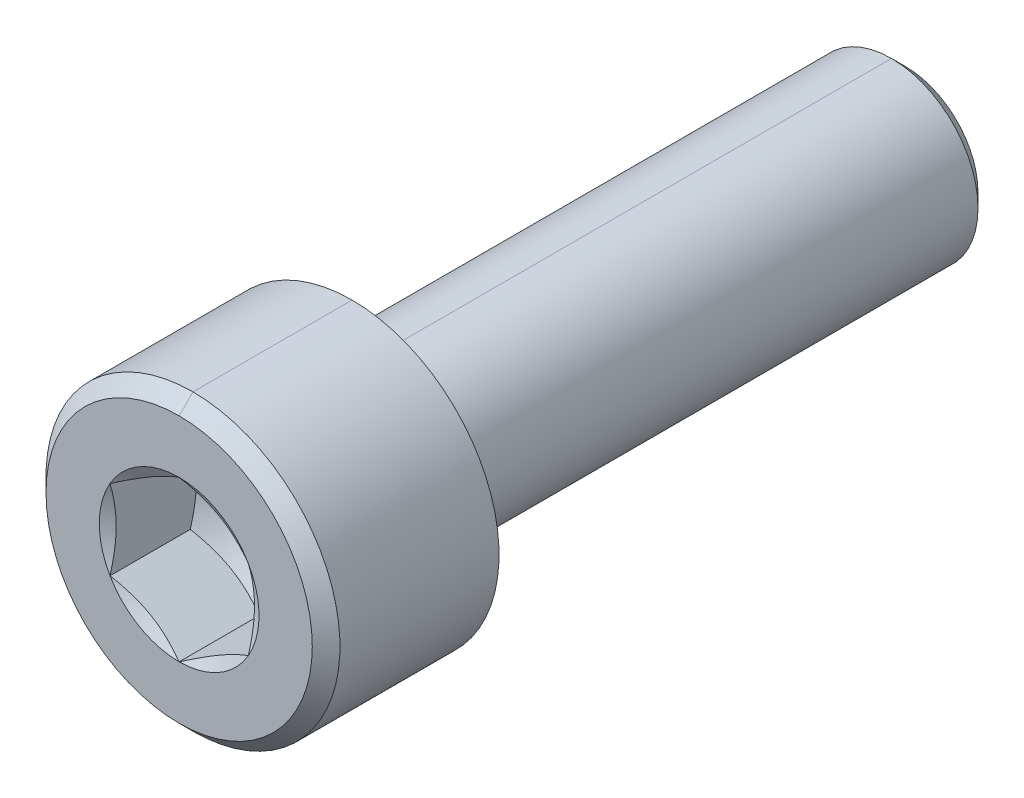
ISO-10303-21;
HEADER;
FILE_DESCRIPTION(('STEP AP214'),'2;1');
FILE_NAME('part.step','',(''),(''),'','','');
FILE_SCHEMA(('AUTOMOTIVE_DESIGN { 1 0 10303 214 1 1 1 1 }'));
ENDSEC;
DATA;
#1=APPLICATION_CONTEXT('core data for automotive mechanical design processes');
#2=APPLICATION_PROTOCOL_DEFINITION('international standard','automotive_design',2000,#1);
#3=PRODUCT_CONTEXT('',#1,'mechanical');
#4=PRODUCT('Part','Part','',(#3));
#5=PRODUCT_RELATED_PRODUCT_CATEGORY('part','',(#4));
#6=PRODUCT_DEFINITION_FORMATION('','',#4);
#7=PRODUCT_DEFINITION_CONTEXT('part definition',#1,'design');
#8=PRODUCT_DEFINITION('design','',#6,#7);
#9=PRODUCT_DEFINITION_SHAPE('','',#8);
#10=(LENGTH_UNIT() NAMED_UNIT(*) SI_UNIT(.MILLI.,.METRE.));
#11=(NAMED_UNIT(*) PLANE_ANGLE_UNIT() SI_UNIT($,.RADIAN.));
#12=(NAMED_UNIT(*) SI_UNIT($,.STERADIAN.) SOLID_ANGLE_UNIT());
#13=UNCERTAINTY_MEASURE_WITH_UNIT(LENGTH_MEASURE(1.E-05),#10,'distance_accuracy_value','');
#14=(GEOMETRIC_REPRESENTATION_CONTEXT(3) GLOBAL_UNCERTAINTY_ASSIGNED_CONTEXT((#13)) GLOBAL_UNIT_ASSIGNED_CONTEXT((#10,
#11,#12)) REPRESENTATION_CONTEXT('',''));
#15=CARTESIAN_POINT('',(0.,0.,0.));
#16=DIRECTION('',(0.,0.,1.));
#17=DIRECTION('',(1.,0.,0.));
#18=AXIS2_PLACEMENT_3D('',#15,#16,#17);
#19=CARTESIAN_POINT('',(2.,1.154700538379,-16.001));
#20=DIRECTION('',(0.500000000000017,0.866025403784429,0.));
#21=DIRECTION('',(0.,0.,-1.));
#22=AXIS2_PLACEMENT_3D('',#19,#20,#21);
#23=PLANE('',#22);
#24=DIRECTION('',(0.,0.,-1.));
#25=VECTOR('',#24,1.);
#26=CARTESIAN_POINT('',(0.,2.309401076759,5.));
#27=LINE('',#26,#25);
#28=CARTESIAN_POINT('',(0.,2.309401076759,5.));
#29=VERTEX_POINT('',#28);
#30=CARTESIAN_POINT('',(0.,2.309401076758,2.678632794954));
#31=VERTEX_POINT('',#30);
#32=EDGE_CURVE('E517',#29,#31,#27,.T.);
#33=ORIENTED_EDGE('',*,*,#32,.T.);
#34=CARTESIAN_POINT('',(1.99999999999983,1.1547005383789,2.67863279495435));
#35=CARTESIAN_POINT('',(1.95801085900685,1.17894000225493,2.66463684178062));
#36=CARTESIAN_POINT('',(1.9158626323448,1.20326208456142,2.65124361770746));
#37=CARTESIAN_POINT('',(1.83232483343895,1.25146918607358,2.62615601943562));
#38=CARTESIAN_POINT('',(1.79094297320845,1.2753497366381,2.61442729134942));
#39=CARTESIAN_POINT('',(1.70874091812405,1.32280491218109,2.59266350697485));
#40=CARTESIAN_POINT('',(1.66792649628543,1.34637583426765,2.58259877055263));
#41=CARTESIAN_POINT('',(1.58663122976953,1.39334468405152,2.56416342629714));
#42=CARTESIAN_POINT('',(1.54615407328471,1.41674019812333,2.55577046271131));
#43=CARTESIAN_POINT('',(1.46305092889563,1.46470165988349,2.54024024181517));
#44=CARTESIAN_POINT('',(1.42041267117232,1.48927136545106,2.53317968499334));
#45=CARTESIAN_POINT('',(1.33570175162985,1.53809491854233,2.52111074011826));
#46=CARTESIAN_POINT('',(1.2936327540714,1.56234647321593,2.51606764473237));
#47=CARTESIAN_POINT('',(1.20968648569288,1.61081288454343,2.50802275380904));
#48=CARTESIAN_POINT('',(1.16781003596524,1.63502673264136,2.50500642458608));
#49=CARTESIAN_POINT('',(1.0838064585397,1.68362115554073,2.50099027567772));
#50=CARTESIAN_POINT('',(1.04167904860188,1.70800199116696,2.49999955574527));
#51=CARTESIAN_POINT('',(0.95749422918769,1.75660531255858,2.50001470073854));
#52=CARTESIAN_POINT('',(0.915436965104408,1.78082805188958,2.50101485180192));
#53=CARTESIAN_POINT('',(0.831574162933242,1.82915898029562,2.50504329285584));
#54=CARTESIAN_POINT('',(0.789768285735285,1.85326724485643,2.50806358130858));
#55=CARTESIAN_POINT('',(0.706005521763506,1.90164257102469,2.51610820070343));
#56=CARTESIAN_POINT('',(0.664049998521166,1.92590940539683,2.5211479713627));
#57=CARTESIAN_POINT('',(0.579553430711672,1.97478384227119,2.53320196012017));
#58=CARTESIAN_POINT('',(0.537016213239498,1.99938927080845,2.54025152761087));
#59=CARTESIAN_POINT('',(0.453973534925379,2.04734499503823,2.55576591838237));
#60=CARTESIAN_POINT('',(0.413459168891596,2.07070386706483,2.56415708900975));
#61=CARTESIAN_POINT('',(0.332108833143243,2.11762862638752,2.58259060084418));
#62=CARTESIAN_POINT('',(0.291276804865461,2.14119255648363,2.59265526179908));
#63=CARTESIAN_POINT('',(0.2090566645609,2.18865999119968,2.61441975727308));
#64=CARTESIAN_POINT('',(0.16767464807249,2.21256036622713,2.62614924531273));
#65=CARTESIAN_POINT('',(0.0841393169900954,2.26080899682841,2.65123936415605));
#66=CARTESIAN_POINT('',(0.0419937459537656,2.28515284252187,2.66463434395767));
#67=CARTESIAN_POINT('',(0.,2.30940107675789,2.67863279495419));
#68=B_SPLINE_CURVE_WITH_KNOTS('',3,(#34,#35,#36,#37,#38,#39,#40,#41,#42,#43,#44,#45,#46,#47,#48,
#49,#50,#51,#52,#53,#54,#55,#56,#57,#58,#59,#60,#61,#62,#63,#64,#65,#66,#67),.UNSPECIFIED.,.F.,
.F.,(4,2,2,2,2,2,2,2,2,2,2,2,2,2,2,2,4),(0.,0.151392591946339,0.29896297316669,
0.443521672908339,0.585993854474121,0.735102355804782,0.881522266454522,1.02688068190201,
1.17289067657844,1.31848222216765,1.46350048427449,1.60964929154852,1.75854660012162,
1.90105886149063,2.04565193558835,2.19325210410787,2.34467088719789),.UNSPECIFIED.);
#69=CARTESIAN_POINT('',(2.,1.154700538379,2.678632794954));
#70=VERTEX_POINT('',#69);
#71=EDGE_CURVE('E290',#70,#31,#68,.T.);
#72=ORIENTED_EDGE('',*,*,#71,.F.);
#73=DIRECTION('',(0.,0.,-1.));
#74=VECTOR('',#73,1.);
#75=CARTESIAN_POINT('',(2.,1.154700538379,5.));
#76=LINE('',#75,#74);
#77=CARTESIAN_POINT('',(2.,1.154700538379,5.));
#78=VERTEX_POINT('',#77);
#79=EDGE_CURVE('E547',#78,#70,#76,.T.);
#80=ORIENTED_EDGE('',*,*,#79,.F.);
#81=CARTESIAN_POINT('',(0.,2.30940107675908,4.99999999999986));
#82=CARTESIAN_POINT('',(0.0419833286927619,2.28515896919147,4.9860050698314));
#83=CARTESIAN_POINT('',(0.0841190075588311,2.26082208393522,4.97261379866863));
#84=CARTESIAN_POINT('',(0.167642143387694,2.21258360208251,4.94752844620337));
#85=CARTESIAN_POINT('',(0.209021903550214,2.18868637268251,4.93580025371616));
#86=CARTESIAN_POINT('',(0.291243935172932,2.1412206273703,4.91403592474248));
#87=CARTESIAN_POINT('',(0.332080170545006,2.11765522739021,4.90397038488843));
#88=CARTESIAN_POINT('',(0.413442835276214,2.07072038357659,4.8855316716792));
#89=CARTESIAN_POINT('',(0.453965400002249,2.04735292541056,4.87713644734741));
#90=CARTESIAN_POINT('',(0.536994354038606,1.99939851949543,4.86162093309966));
#91=CARTESIAN_POINT('',(0.579509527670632,1.97480318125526,4.85457305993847));
#92=CARTESIAN_POINT('',(0.663978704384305,1.92594497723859,4.84252128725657));
#93=CARTESIAN_POINT('',(0.705928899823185,1.90168417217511,4.83748263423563));
#94=CARTESIAN_POINT('',(0.78969468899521,1.8533130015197,4.82943832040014));
#95=CARTESIAN_POINT('',(0.831508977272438,1.82920285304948,4.82641787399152));
#96=CARTESIAN_POINT('',(0.915399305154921,1.78085596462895,4.82238612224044));
#97=CARTESIAN_POINT('',(0.957475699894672,1.75661912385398,4.82138345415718));
#98=CARTESIAN_POINT('',(1.04165779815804,1.70801114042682,4.82136521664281));
#99=CARTESIAN_POINT('',(1.08376340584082,1.68363983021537,4.82235342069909));
#100=CARTESIAN_POINT('',(1.16773937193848,1.63506128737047,4.82636626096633));
#101=CARTESIAN_POINT('',(1.2096099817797,1.61085379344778,4.82938243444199));
#102=CARTESIAN_POINT('',(1.29355834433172,1.56239209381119,4.83742763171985));
#103=CARTESIAN_POINT('',(1.33563523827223,1.53813894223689,4.84247184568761));
#104=CARTESIAN_POINT('',(1.42037393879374,1.48929976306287,4.85454300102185));
#105=CARTESIAN_POINT('',(1.46303197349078,1.46471598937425,4.86160524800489));
#106=CARTESIAN_POINT('',(1.54614311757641,1.41674328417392,4.87713433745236));
#107=CARTESIAN_POINT('',(1.58660871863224,1.39335058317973,4.88552324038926));
#108=CARTESIAN_POINT('',(1.66788906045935,1.34638737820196,4.90395337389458));
#109=CARTESIAN_POINT('',(1.70870009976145,1.32281936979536,4.914017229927));
#110=CARTESIAN_POINT('',(1.79090267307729,1.27536668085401,4.93578118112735));
#111=CARTESIAN_POINT('',(1.83228839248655,1.25148574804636,4.94751120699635));
#112=CARTESIAN_POINT('',(1.91584110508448,1.20327314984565,4.97260358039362));
#113=CARTESIAN_POINT('',(1.95800032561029,1.17894597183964,4.98600051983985));
#114=CARTESIAN_POINT('',(2.00000000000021,1.15470053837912,4.99999999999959));
#115=B_SPLINE_CURVE_WITH_KNOTS('',3,(#81,#82,#83,#84,#85,#86,#87,#88,#89,#90,#91,#92,#93,#94,
#95,#96,#97,#98,#99,#100,#101,#102,#103,#104,#105,#106,#107,#108,#109,#110,#111,#112,#113,#114),
.UNSPECIFIED.,.F.,.F.,(4,2,2,2,2,2,2,2,2,2,2,2,2,2,2,2,4),(0.,0.151380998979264,
0.298969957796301,0.443576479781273,0.586124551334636,0.734949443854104,0.881075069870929,
1.02611807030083,1.17178062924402,1.31771953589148,1.46305318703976,1.60949630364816,
1.75867729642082,1.90111360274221,2.04565883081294,2.19324044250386,2.34467088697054),.UNSPECIFIED.);
#116=EDGE_CURVE('E11',#29,#78,#115,.T.);
#117=ORIENTED_EDGE('',*,*,#116,.F.);
#118=EDGE_LOOP('',(#33,#72,#80,#117));
#119=FACE_BOUND('',#118,.T.);
#120=ADVANCED_FACE('F17',(#119),#23,.F.);
#121=CARTESIAN_POINT('',(0.,0.,4.910153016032));
#122=DIRECTION('',(0.,0.,1.));
#123=DIRECTION('',(0.,-1.,0.));
#124=AXIS2_PLACEMENT_3D('',#121,#122,#123);
#125=CONICAL_SURFACE('',#124,2.15378153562,1.0471975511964);
#126=ORIENTED_EDGE('',*,*,#116,.T.);
#127=CARTESIAN_POINT('',(0.,0.,5.));
#128=DIRECTION('',(0.,0.,-1.));
#129=DIRECTION('',(0.,1.,0.));
#130=AXIS2_PLACEMENT_3D('',#127,#128,#129);
#131=CIRCLE('',#130,2.309401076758);
#132=EDGE_CURVE('E29',#29,#78,#131,.T.);
#133=ORIENTED_EDGE('',*,*,#132,.F.);
#134=EDGE_LOOP('',(#126,#133));
#135=FACE_BOUND('',#134,.T.);
#136=ADVANCED_FACE('F587',(#135),#125,.F.);
#137=CARTESIAN_POINT('',(0.,4.25,5.));
#138=DIRECTION('',(0.,0.,-1.));
#139=DIRECTION('',(0.,-1.,0.));
#140=AXIS2_PLACEMENT_3D('',#137,#138,#139);
#141=PLANE('',#140);
#142=ORIENTED_EDGE('',*,*,#132,.T.);
#143=CARTESIAN_POINT('',(0.,0.,5.));
#144=DIRECTION('',(0.,0.,-1.));
#145=DIRECTION('',(0.866025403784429,0.500000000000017,0.));
#146=AXIS2_PLACEMENT_3D('',#143,#144,#145);
#147=CIRCLE('',#146,2.309401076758);
#148=CARTESIAN_POINT('',(2.,-1.154700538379,5.));
#149=VERTEX_POINT('',#148);
#150=EDGE_CURVE('E549',#78,#149,#147,.T.);
#151=ORIENTED_EDGE('',*,*,#150,.T.);
#152=CARTESIAN_POINT('',(0.,0.,5.));
#153=DIRECTION('',(0.,0.,-1.));
#154=DIRECTION('',(0.866025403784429,-0.500000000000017,0.));
#155=AXIS2_PLACEMENT_3D('',#152,#153,#154);
#156=CIRCLE('',#155,2.309401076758);
#157=CARTESIAN_POINT('',(0.,-2.309401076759,5.));
#158=VERTEX_POINT('',#157);
#159=EDGE_CURVE('E169',#149,#158,#156,.T.);
#160=ORIENTED_EDGE('',*,*,#159,.T.);
#161=CARTESIAN_POINT('',(0.,0.,5.));
#162=DIRECTION('',(0.,0.,-1.));
#163=DIRECTION('',(0.,-1.,0.));
#164=AXIS2_PLACEMENT_3D('',#161,#162,#163);
#165=CIRCLE('',#164,2.309401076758);
#166=CARTESIAN_POINT('',(-2.,-1.154700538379,5.));
#167=VERTEX_POINT('',#166);
#168=EDGE_CURVE('E160',#158,#167,#165,.T.);
#169=ORIENTED_EDGE('',*,*,#168,.T.);
#170=CARTESIAN_POINT('',(0.,0.,5.));
#171=DIRECTION('',(0.,0.,-1.));
#172=DIRECTION('',(-0.866025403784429,-0.500000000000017,0.));
#173=AXIS2_PLACEMENT_3D('',#170,#171,#172);
#174=CIRCLE('',#173,2.309401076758);
#175=CARTESIAN_POINT('',(-2.,1.154700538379,5.));
#176=VERTEX_POINT('',#175);
#177=EDGE_CURVE('E166',#167,#176,#174,.T.);
#178=ORIENTED_EDGE('',*,*,#177,.T.);
#179=CARTESIAN_POINT('',(0.,0.,5.));
#180=DIRECTION('',(0.,0.,-1.));
#181=DIRECTION('',(-0.866025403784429,0.500000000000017,0.));
#182=AXIS2_PLACEMENT_3D('',#179,#180,#181);
#183=CIRCLE('',#182,2.309401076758);
#184=EDGE_CURVE('E565',#176,#29,#183,.T.);
#185=ORIENTED_EDGE('',*,*,#184,.T.);
#186=EDGE_LOOP('',(#142,#151,#160,#169,#178,#185));
#187=FACE_BOUND('',#186,.T.);
#188=CARTESIAN_POINT('',(0.,0.,5.));
#189=DIRECTION('',(0.,0.,1.));
#190=DIRECTION('',(0.,-1.,0.));
#191=AXIS2_PLACEMENT_3D('',#188,#189,#190);
#192=CIRCLE('',#191,3.85);
#193=CARTESIAN_POINT('',(0.,-3.85,5.));
#194=VERTEX_POINT('',#193);
#195=CARTESIAN_POINT('',(0.,3.85,5.));
#196=VERTEX_POINT('',#195);
#197=EDGE_CURVE('E1115',#194,#196,#192,.T.);
#198=ORIENTED_EDGE('',*,*,#197,.T.);
#199=CARTESIAN_POINT('',(0.,0.,5.));
#200=DIRECTION('',(0.,0.,1.));
#201=DIRECTION('',(0.,1.,0.));
#202=AXIS2_PLACEMENT_3D('',#199,#200,#201);
#203=CIRCLE('',#202,3.85);
#204=EDGE_CURVE('E42',#196,#194,#203,.T.);
#205=ORIENTED_EDGE('',*,*,#204,.T.);
#206=EDGE_LOOP('',(#198,#205));
#207=FACE_BOUND('',#206,.T.);
#208=ADVANCED_FACE('F163',(#187,#207),#141,.F.);
#209=CARTESIAN_POINT('',(0.,0.,4.8));
#210=DIRECTION('',(0.,0.,-1.));
#211=DIRECTION('',(0.,1.,0.));
#212=AXIS2_PLACEMENT_3D('',#209,#210,#211);
#213=CONICAL_SURFACE('',#212,4.05,0.785398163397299);
#214=ORIENTED_EDGE('',*,*,#204,.F.);
#215=DIRECTION('',(0.,-0.707106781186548,0.707106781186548));
#216=VECTOR('',#215,1.);
#217=CARTESIAN_POINT('',(0.,4.25,4.6));
#218=LINE('',#217,#216);
#219=CARTESIAN_POINT('',(0.,4.25,4.6));
#220=VERTEX_POINT('',#219);
#221=EDGE_CURVE('E1120',#220,#196,#218,.T.);
#222=ORIENTED_EDGE('',*,*,#221,.F.);
#223=CARTESIAN_POINT('',(0.,0.,4.6));
#224=DIRECTION('',(0.,0.,1.));
#225=DIRECTION('',(0.,1.,0.));
#226=AXIS2_PLACEMENT_3D('',#223,#224,#225);
#227=CIRCLE('',#226,4.25);
#228=CARTESIAN_POINT('',(0.,-4.25,4.6));
#229=VERTEX_POINT('',#228);
#230=EDGE_CURVE('E1143',#220,#229,#227,.T.);
#231=ORIENTED_EDGE('',*,*,#230,.T.);
#232=DIRECTION('',(0.,0.707106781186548,0.707106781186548));
#233=VECTOR('',#232,1.);
#234=CARTESIAN_POINT('',(0.,-4.25,4.6));
#235=LINE('',#234,#233);
#236=EDGE_CURVE('E1127',#229,#194,#235,.T.);
#237=ORIENTED_EDGE('',*,*,#236,.T.);
#238=EDGE_LOOP('',(#214,#222,#231,#237));
#239=FACE_BOUND('',#238,.T.);
#240=ADVANCED_FACE('F597',(#239),#213,.T.);
#241=CARTESIAN_POINT('',(0.,0.,4.8));
#242=DIRECTION('',(0.,0.,-1.));
#243=DIRECTION('',(0.,1.,0.));
#244=AXIS2_PLACEMENT_3D('',#241,#242,#243);
#245=CONICAL_SURFACE('',#244,4.05,0.785398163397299);
#246=ORIENTED_EDGE('',*,*,#236,.F.);
#247=CARTESIAN_POINT('',(0.,0.,4.6));
#248=DIRECTION('',(0.,0.,1.));
#249=DIRECTION('',(0.,-1.,0.));
#250=AXIS2_PLACEMENT_3D('',#247,#248,#249);
#251=CIRCLE('',#250,4.25);
#252=EDGE_CURVE('E1131',#229,#220,#251,.T.);
#253=ORIENTED_EDGE('',*,*,#252,.T.);
#254=ORIENTED_EDGE('',*,*,#221,.T.);
#255=ORIENTED_EDGE('',*,*,#197,.F.);
#256=EDGE_LOOP('',(#246,#253,#254,#255));
#257=FACE_BOUND('',#256,.T.);
#258=ADVANCED_FACE('F600',(#257),#245,.T.);
#259=CARTESIAN_POINT('',(0.,0.,5.));
#260=DIRECTION('',(0.,0.,1.));
#261=DIRECTION('',(0.,-1.,0.));
#262=AXIS2_PLACEMENT_3D('',#259,#260,#261);
#263=CYLINDRICAL_SURFACE('',#262,4.25);
#264=DIRECTION('',(0.,0.,-1.));
#265=VECTOR('',#264,1.);
#266=CARTESIAN_POINT('',(0.,4.25,4.6));
#267=LINE('',#266,#265);
#268=CARTESIAN_POINT('',(0.,4.25,0.));
#269=VERTEX_POINT('',#268);
#270=EDGE_CURVE('E1139',#220,#269,#267,.T.);
#271=ORIENTED_EDGE('',*,*,#270,.F.);
#272=ORIENTED_EDGE('',*,*,#252,.F.);
#273=DIRECTION('',(0.,0.,-1.));
#274=VECTOR('',#273,1.);
#275=CARTESIAN_POINT('',(0.,-4.25,4.6));
#276=LINE('',#275,#274);
#277=CARTESIAN_POINT('',(0.,-4.25,0.));
#278=VERTEX_POINT('',#277);
#279=EDGE_CURVE('E1151',#229,#278,#276,.T.);
#280=ORIENTED_EDGE('',*,*,#279,.T.);
#281=CARTESIAN_POINT('',(0.,0.,0.));
#282=DIRECTION('',(0.,0.,-1.));
#283=DIRECTION('',(0.,1.,0.));
#284=AXIS2_PLACEMENT_3D('',#281,#282,#283);
#285=CIRCLE('',#284,4.25);
#286=EDGE_CURVE('E1135',#269,#278,#285,.T.);
#287=ORIENTED_EDGE('',*,*,#286,.F.);
#288=EDGE_LOOP('',(#271,#272,#280,#287));
#289=FACE_BOUND('',#288,.T.);
#290=ADVANCED_FACE('F603',(#289),#263,.T.);
#291=CARTESIAN_POINT('',(0.,2.5,0.));
#292=DIRECTION('',(0.,0.,1.));
#293=DIRECTION('',(1.,0.,0.));
#294=AXIS2_PLACEMENT_3D('',#291,#292,#293);
#295=PLANE('',#294);
#296=CARTESIAN_POINT('',(0.,0.,0.));
#297=DIRECTION('',(0.,0.,1.));
#298=DIRECTION('',(0.,1.,0.));
#299=AXIS2_PLACEMENT_3D('',#296,#297,#298);
#300=CIRCLE('',#299,2.9);
#301=CARTESIAN_POINT('',(0.,2.9,0.));
#302=VERTEX_POINT('',#301);
#303=CARTESIAN_POINT('',(0.,-2.9,0.));
#304=VERTEX_POINT('',#303);
#305=EDGE_CURVE('E1163',#302,#304,#300,.T.);
#306=ORIENTED_EDGE('',*,*,#305,.T.);
#307=CARTESIAN_POINT('',(0.,0.,0.));
#308=DIRECTION('',(0.,0.,1.));
#309=DIRECTION('',(0.,-1.,0.));
#310=AXIS2_PLACEMENT_3D('',#307,#308,#309);
#311=CIRCLE('',#310,2.9);
#312=EDGE_CURVE('E1152',#304,#302,#311,.T.);
#313=ORIENTED_EDGE('',*,*,#312,.T.);
#314=EDGE_LOOP('',(#306,#313));
#315=FACE_BOUND('',#314,.T.);
#316=CARTESIAN_POINT('',(0.,0.,0.));
#317=DIRECTION('',(0.,0.,-1.));
#318=DIRECTION('',(0.,-1.,0.));
#319=AXIS2_PLACEMENT_3D('',#316,#317,#318);
#320=CIRCLE('',#319,4.25);
#321=EDGE_CURVE('E1147',#278,#269,#320,.T.);
#322=ORIENTED_EDGE('',*,*,#321,.T.);
#323=ORIENTED_EDGE('',*,*,#286,.T.);
#324=EDGE_LOOP('',(#322,#323));
#325=FACE_BOUND('',#324,.T.);
#326=ADVANCED_FACE('F607',(#315,#325),#295,.F.);
#327=CARTESIAN_POINT('',(0.,0.,5.));
#328=DIRECTION('',(0.,0.,1.));
#329=DIRECTION('',(0.,-1.,0.));
#330=AXIS2_PLACEMENT_3D('',#327,#328,#329);
#331=CYLINDRICAL_SURFACE('',#330,4.25);
#332=ORIENTED_EDGE('',*,*,#321,.F.);
#333=ORIENTED_EDGE('',*,*,#279,.F.);
#334=ORIENTED_EDGE('',*,*,#230,.F.);
#335=ORIENTED_EDGE('',*,*,#270,.T.);
#336=EDGE_LOOP('',(#332,#333,#334,#335));
#337=FACE_BOUND('',#336,.T.);
#338=ADVANCED_FACE('F611',(#337),#331,.T.);
#339=CARTESIAN_POINT('',(0.,0.,-0.4));
#340=DIRECTION('',(0.,0.,1.));
#341=DIRECTION('',(0.,-1.,0.));
#342=AXIS2_PLACEMENT_3D('',#339,#340,#341);
#343=TOROIDAL_SURFACE('',#342,2.9,0.4);
#344=ORIENTED_EDGE('',*,*,#312,.F.);
#345=CARTESIAN_POINT('',(0.,-2.9,-0.4));
#346=DIRECTION('',(1.,0.,0.));
#347=DIRECTION('',(0.,1.,0.));
#348=AXIS2_PLACEMENT_3D('',#345,#346,#347);
#349=CIRCLE('',#348,0.4);
#350=CARTESIAN_POINT('',(0.,-2.5,-0.4));
#351=VERTEX_POINT('',#350);
#352=EDGE_CURVE('E1167',#351,#304,#349,.T.);
#353=ORIENTED_EDGE('',*,*,#352,.F.);
#354=CARTESIAN_POINT('',(0.,0.,-0.4));
#355=DIRECTION('',(0.,0.,1.));
#356=DIRECTION('',(0.,-1.,0.));
#357=AXIS2_PLACEMENT_3D('',#354,#355,#356);
#358=CIRCLE('',#357,2.5);
#359=CARTESIAN_POINT('',(0.,2.5,-0.4));
#360=VERTEX_POINT('',#359);
#361=EDGE_CURVE('E1197',#351,#360,#358,.T.);
#362=ORIENTED_EDGE('',*,*,#361,.T.);
#363=CARTESIAN_POINT('',(0.,2.9,-0.4));
#364=DIRECTION('',(-1.,0.,0.));
#365=DIRECTION('',(0.,-1.,0.));
#366=AXIS2_PLACEMENT_3D('',#363,#364,#365);
#367=CIRCLE('',#366,0.4);
#368=EDGE_CURVE('E1171',#360,#302,#367,.T.);
#369=ORIENTED_EDGE('',*,*,#368,.T.);
#370=EDGE_LOOP('',(#344,#353,#362,#369));
#371=FACE_BOUND('',#370,.T.);
#372=ADVANCED_FACE('F615',(#371),#343,.F.);
#373=CARTESIAN_POINT('',(0.,0.,-0.4));
#374=DIRECTION('',(0.,0.,1.));
#375=DIRECTION('',(0.,-1.,0.));
#376=AXIS2_PLACEMENT_3D('',#373,#374,#375);
#377=TOROIDAL_SURFACE('',#376,2.9,0.4);
#378=ORIENTED_EDGE('',*,*,#368,.F.);
#379=CARTESIAN_POINT('',(0.,0.,-0.4));
#380=DIRECTION('',(0.,0.,1.));
#381=DIRECTION('',(0.,1.,0.));
#382=AXIS2_PLACEMENT_3D('',#379,#380,#381);
#383=CIRCLE('',#382,2.5);
#384=EDGE_CURVE('E1178',#360,#351,#383,.T.);
#385=ORIENTED_EDGE('',*,*,#384,.T.);
#386=ORIENTED_EDGE('',*,*,#352,.T.);
#387=ORIENTED_EDGE('',*,*,#305,.F.);
#388=EDGE_LOOP('',(#378,#385,#386,#387));
#389=FACE_BOUND('',#388,.T.);
#390=ADVANCED_FACE('F619',(#389),#377,.F.);
#391=CARTESIAN_POINT('',(0.,0.,5.));
#392=DIRECTION('',(0.,0.,1.));
#393=DIRECTION('',(0.,-1.,0.));
#394=AXIS2_PLACEMENT_3D('',#391,#392,#393);
#395=CYLINDRICAL_SURFACE('',#394,2.5);
#396=CARTESIAN_POINT('',(0.,0.,-15.6));
#397=DIRECTION('',(0.,0.,-1.));
#398=DIRECTION('',(0.,-1.,0.));
#399=AXIS2_PLACEMENT_3D('',#396,#397,#398);
#400=CIRCLE('',#399,2.5);
#401=CARTESIAN_POINT('',(0.,-2.5,-15.6));
#402=VERTEX_POINT('',#401);
#403=CARTESIAN_POINT('',(0.,2.5,-15.6));
#404=VERTEX_POINT('',#403);
#405=EDGE_CURVE('E1217',#402,#404,#400,.T.);
#406=ORIENTED_EDGE('',*,*,#405,.F.);
#407=DIRECTION('',(0.,0.,-1.));
#408=VECTOR('',#407,1.);
#409=CARTESIAN_POINT('',(0.,-2.5,-0.4));
#410=LINE('',#409,#408);
#411=EDGE_CURVE('E1191',#351,#402,#410,.T.);
#412=ORIENTED_EDGE('',*,*,#411,.F.);
#413=ORIENTED_EDGE('',*,*,#384,.F.);
#414=DIRECTION('',(0.,0.,-1.));
#415=VECTOR('',#414,1.);
#416=CARTESIAN_POINT('',(0.,2.5,-0.4));
#417=LINE('',#416,#415);
#418=EDGE_CURVE('E1271',#360,#404,#417,.T.);
#419=ORIENTED_EDGE('',*,*,#418,.T.);
#420=EDGE_LOOP('',(#406,#412,#413,#419));
#421=FACE_BOUND('',#420,.T.);
#422=ADVANCED_FACE('F623',(#421),#395,.T.);
#423=CARTESIAN_POINT('',(0.,0.,5.));
#424=DIRECTION('',(0.,0.,1.));
#425=DIRECTION('',(0.,-1.,0.));
#426=AXIS2_PLACEMENT_3D('',#423,#424,#425);
#427=CYLINDRICAL_SURFACE('',#426,2.5);
#428=ORIENTED_EDGE('',*,*,#418,.F.);
#429=ORIENTED_EDGE('',*,*,#361,.F.);
#430=ORIENTED_EDGE('',*,*,#411,.T.);
#431=CARTESIAN_POINT('',(0.,0.,-15.6));
#432=DIRECTION('',(0.,0.,-1.));
#433=DIRECTION('',(0.,1.,0.));
#434=AXIS2_PLACEMENT_3D('',#431,#432,#433);
#435=CIRCLE('',#434,2.5);
#436=EDGE_CURVE('E1204',#404,#402,#435,.T.);
#437=ORIENTED_EDGE('',*,*,#436,.F.);
#438=EDGE_LOOP('',(#428,#429,#430,#437));
#439=FACE_BOUND('',#438,.T.);
#440=ADVANCED_FACE('F627',(#439),#427,.T.);
#441=CARTESIAN_POINT('',(0.,0.,-15.8));
#442=DIRECTION('',(0.,0.,1.));
#443=DIRECTION('',(0.,-1.,0.));
#444=AXIS2_PLACEMENT_3D('',#441,#442,#443);
#445=CONICAL_SURFACE('',#444,2.3,0.785398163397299);
#446=DIRECTION('',(0.,-0.707106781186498,-0.707106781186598));
#447=VECTOR('',#446,1.);
#448=CARTESIAN_POINT('',(0.,2.5,-15.6));
#449=LINE('',#448,#447);
#450=CARTESIAN_POINT('',(0.,2.1,-16.));
#451=VERTEX_POINT('',#450);
#452=EDGE_CURVE('E1205',#404,#451,#449,.T.);
#453=ORIENTED_EDGE('',*,*,#452,.F.);
#454=ORIENTED_EDGE('',*,*,#436,.T.);
#455=DIRECTION('',(0.,0.707106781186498,-0.707106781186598));
#456=VECTOR('',#455,1.);
#457=CARTESIAN_POINT('',(0.,-2.5,-15.6));
#458=LINE('',#457,#456);
#459=CARTESIAN_POINT('',(0.,-2.1,-16.));
#460=VERTEX_POINT('',#459);
#461=EDGE_CURVE('E1227',#402,#460,#458,.T.);
#462=ORIENTED_EDGE('',*,*,#461,.T.);
#463=CARTESIAN_POINT('',(0.,0.,-16.));
#464=DIRECTION('',(0.,0.,-1.));
#465=DIRECTION('',(0.,1.,0.));
#466=AXIS2_PLACEMENT_3D('',#463,#464,#465);
#467=CIRCLE('',#466,2.1);
#468=EDGE_CURVE('E1201',#451,#460,#467,.T.);
#469=ORIENTED_EDGE('',*,*,#468,.F.);
#470=EDGE_LOOP('',(#453,#454,#462,#469));
#471=FACE_BOUND('',#470,.T.);
#472=ADVANCED_FACE('F341',(#471),#445,.T.);
#473=CARTESIAN_POINT('',(0.,0.,-16.));
#474=DIRECTION('',(0.,0.,1.));
#475=DIRECTION('',(1.,0.,0.));
#476=AXIS2_PLACEMENT_3D('',#473,#474,#475);
#477=PLANE('',#476);
#478=ORIENTED_EDGE('',*,*,#468,.T.);
#479=CARTESIAN_POINT('',(0.,0.,-16.));
#480=DIRECTION('',(0.,0.,-1.));
#481=DIRECTION('',(0.,-1.,0.));
#482=AXIS2_PLACEMENT_3D('',#479,#480,#481);
#483=CIRCLE('',#482,2.1);
#484=EDGE_CURVE('E568',#460,#451,#483,.T.);
#485=ORIENTED_EDGE('',*,*,#484,.T.);
#486=EDGE_LOOP('',(#478,#485));
#487=FACE_BOUND('',#486,.T.);
#488=ADVANCED_FACE('F235',(#487),#477,.F.);
#489=CARTESIAN_POINT('',(0.,0.,-15.8));
#490=DIRECTION('',(0.,0.,1.));
#491=DIRECTION('',(0.,-1.,0.));
#492=AXIS2_PLACEMENT_3D('',#489,#490,#491);
#493=CONICAL_SURFACE('',#492,2.3,0.785398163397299);
#494=ORIENTED_EDGE('',*,*,#484,.F.);
#495=ORIENTED_EDGE('',*,*,#461,.F.);
#496=ORIENTED_EDGE('',*,*,#405,.T.);
#497=ORIENTED_EDGE('',*,*,#452,.T.);
#498=EDGE_LOOP('',(#494,#495,#496,#497));
#499=FACE_BOUND('',#498,.T.);
#500=ADVANCED_FACE('F233',(#499),#493,.T.);
#501=CARTESIAN_POINT('',(0.,0.,4.910153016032));
#502=DIRECTION('',(0.,0.,1.));
#503=DIRECTION('',(0.,-1.,0.));
#504=AXIS2_PLACEMENT_3D('',#501,#502,#503);
#505=CONICAL_SURFACE('',#504,2.15378153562,1.0471975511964);
#506=CARTESIAN_POINT('',(-2.00000000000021,1.15470053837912,4.99999999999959));
#507=CARTESIAN_POINT('',(-1.95801405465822,1.17893811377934,4.98600506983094));
#508=CARTESIAN_POINT('',(-1.91586985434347,1.20326023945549,4.97261379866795));
#509=CARTESIAN_POINT('',(-1.8323325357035,1.25147415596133,4.94752844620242));
#510=CARTESIAN_POINT('',(-1.7909470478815,1.27536146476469,4.93580025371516));
#511=CARTESIAN_POINT('',(-1.70872949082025,1.32283496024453,4.91403592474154));
#512=CARTESIAN_POINT('',(-1.66790313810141,1.3464174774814,4.90397038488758));
#513=CARTESIAN_POINT('',(-1.58657503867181,1.39341219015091,4.88553167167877));
#514=CARTESIAN_POINT('',(-1.54607694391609,1.41682203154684,4.87713644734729));
#515=CARTESIAN_POINT('',(-1.46303273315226,1.46475001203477,4.86162093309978));
#516=CARTESIAN_POINT('',(-1.42047495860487,1.48927156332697,4.85457305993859));
#517=CARTESIAN_POINT('',(-1.33592792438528,1.53799491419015,4.84252128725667));
#518=CARTESIAN_POINT('',(-1.2939423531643,1.56219444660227,4.83748263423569));
#519=CARTESIAN_POINT('',(-1.21016879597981,1.61055216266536,4.82943832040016));
#520=CARTESIAN_POINT('',(-1.16838165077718,1.63470932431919,4.82641787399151));
#521=CARTESIAN_POINT('',(-1.08456685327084,1.6831870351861,4.82238612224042));
#522=CARTESIAN_POINT('',(-1.04253893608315,1.70750784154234,4.82138345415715));
#523=CARTESIAN_POINT('',(-0.958352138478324,1.75610768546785,4.82136521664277));
#524=CARTESIAN_POINT('',(-0.916193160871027,1.78038655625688,4.82235342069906));
#525=CARTESIAN_POINT('',(-0.832134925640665,1.82882260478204,4.82636626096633));
#526=CARTESIAN_POINT('',(-0.790235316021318,1.85297986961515,4.829382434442));
#527=CARTESIAN_POINT('',(-0.706292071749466,1.90145043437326,4.83742763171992));
#528=CARTESIAN_POINT('',(-0.664249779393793,1.92576351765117,4.84247184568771));
#529=CARTESIAN_POINT('',(-0.579584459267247,1.9747297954,4.85454300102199));
#530=CARTESIAN_POINT('',(-0.536965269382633,1.99938085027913,4.86160524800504));
#531=CARTESIAN_POINT('',(-0.453864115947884,2.0473708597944,4.87713433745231));
#532=CARTESIAN_POINT('',(-0.413372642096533,2.07071874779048,4.88552324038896));
#533=CARTESIAN_POINT('',(-0.3320611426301,2.11762798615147,4.90395337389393));
#534=CARTESIAN_POINT('',(-0.291245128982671,2.14118737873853,4.9140172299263));
#535=CARTESIAN_POINT('',(-0.209048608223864,2.18865055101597,4.93578118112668));
#536=CARTESIAN_POINT('',(-0.167674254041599,2.21255116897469,4.94751120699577));
#537=CARTESIAN_POINT('',(-0.0841445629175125,2.26080364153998,4.97260358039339));
#538=CARTESIAN_POINT('',(-0.0419969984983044,2.28515100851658,4.98600051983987));
#539=CARTESIAN_POINT('',(0.,2.30940107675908,4.99999999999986));
#540=B_SPLINE_CURVE_WITH_KNOTS('',3,(#506,#507,#508,#509,#510,#511,#512,#513,#514,#515,#516,
#517,#518,#519,#520,#521,#522,#523,#524,#525,#526,#527,#528,#529,#530,#531,#532,#533,#534,#535,
#536,#537,#538,#539),.UNSPECIFIED.,.F.,.F.,(4,2,2,2,2,2,2,2,2,2,2,2,2,2,2,2,4),(0.,
0.151380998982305,0.298969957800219,0.443576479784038,0.586124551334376,0.734949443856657,
0.881075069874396,1.0261180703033,1.17178062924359,1.31771953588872,1.46305318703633,
1.60949630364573,1.75867729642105,1.90111360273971,2.04565883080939,2.19324044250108,
2.34467088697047),.UNSPECIFIED.);
#541=EDGE_CURVE('E252',#176,#29,#540,.T.);
#542=ORIENTED_EDGE('',*,*,#541,.T.);
#543=ORIENTED_EDGE('',*,*,#184,.F.);
#544=EDGE_LOOP('',(#542,#543));
#545=FACE_BOUND('',#544,.T.);
#546=ADVANCED_FACE('F228',(#545),#505,.F.);
#547=CARTESIAN_POINT('',(0.,2.309401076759,-16.001));
#548=DIRECTION('',(-0.500000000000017,0.866025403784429,0.));
#549=DIRECTION('',(0.,0.,1.));
#550=AXIS2_PLACEMENT_3D('',#547,#548,#549);
#551=PLANE('',#550);
#552=DIRECTION('',(0.,0.,-1.));
#553=VECTOR('',#552,1.);
#554=CARTESIAN_POINT('',(-2.,1.154700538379,5.));
#555=LINE('',#554,#553);
#556=CARTESIAN_POINT('',(-2.,1.154700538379,2.678632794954));
#557=VERTEX_POINT('',#556);
#558=EDGE_CURVE('E184',#176,#557,#555,.T.);
#559=ORIENTED_EDGE('',*,*,#558,.T.);
#560=CARTESIAN_POINT('',(0.,2.30940107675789,2.67863279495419));
#561=CARTESIAN_POINT('',(-0.0419865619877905,2.28515714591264,2.66463684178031));
#562=CARTESIAN_POINT('',(-0.0841242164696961,2.26081675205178,2.65124361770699));
#563=CARTESIAN_POINT('',(-0.167641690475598,2.21257444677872,2.62615601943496));
#564=CARTESIAN_POINT('',(-0.209013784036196,2.18867697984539,2.61442729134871));
#565=CARTESIAN_POINT('',(-0.291212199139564,2.14121549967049,2.59266350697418));
#566=CARTESIAN_POINT('',(-0.33203242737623,2.11765463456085,2.58259877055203));
#567=CARTESIAN_POINT('',(-0.413356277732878,2.07073529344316,2.56416342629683));
#568=CARTESIAN_POINT('',(-0.453855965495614,2.04737880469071,2.55577046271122));
#569=CARTESIAN_POINT('',(-0.53694338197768,1.9993901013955,2.54024024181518));
#570=CARTESIAN_POINT('',(-0.579540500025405,1.97474913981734,2.53317968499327));
#571=CARTESIAN_POINT('',(-0.664178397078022,1.9257991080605,2.52111074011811));
#572=CARTESIAN_POINT('',(-0.706215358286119,1.90149206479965,2.51606764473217));
#573=CARTESIAN_POINT('',(-0.790161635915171,1.85302566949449,2.50802275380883));
#574=CARTESIAN_POINT('',(-0.832069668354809,1.82886652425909,2.50500642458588));
#575=CARTESIAN_POINT('',(-0.916155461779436,1.78041450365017,2.50099027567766));
#576=CARTESIAN_POINT('',(-0.958333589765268,1.7561215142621,2.49999955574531));
#577=CARTESIAN_POINT('',(-1.04251771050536,1.70751698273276,2.50001470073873));
#578=CARTESIAN_POINT('',(-1.08452385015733,1.68320569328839,2.50101485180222));
#579=CARTESIAN_POINT('',(-1.16831106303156,1.63474384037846,2.50504329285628));
#580=CARTESIAN_POINT('',(-1.21009237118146,1.61059302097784,2.50806358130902));
#581=CARTESIAN_POINT('',(-1.29386801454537,1.56224000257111,2.51610820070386));
#582=CARTESIAN_POINT('',(-1.33586147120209,1.53803887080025,2.5211479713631));
#583=CARTESIAN_POINT('',(-1.4204362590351,1.48929991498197,2.53320196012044));
#584=CARTESIAN_POINT('',(-1.46301379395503,1.46476431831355,2.54025152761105));
#585=CARTESIAN_POINT('',(-1.54606600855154,1.41682511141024,2.55576591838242));
#586=CARTESIAN_POINT('',(-1.58655256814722,1.39341807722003,2.56415708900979));
#587=CARTESIAN_POINT('',(-1.66786576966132,1.34642899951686,2.58259060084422));
#588=CARTESIAN_POINT('',(-1.70868874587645,1.32284939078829,2.59265526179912));
#589=CARTESIAN_POINT('',(-1.79090682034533,1.27537837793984,2.61441975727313));
#590=CARTESIAN_POINT('',(-1.8322961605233,1.25149068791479,2.62614924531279));
#591=CARTESIAN_POINT('',(-1.91584836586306,1.20327128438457,2.65123936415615));
#592=CARTESIAN_POINT('',(-1.9580035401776,1.17894407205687,2.6646343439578));
#593=CARTESIAN_POINT('',(-1.99999999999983,1.1547005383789,2.67863279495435));
#594=B_SPLINE_CURVE_WITH_KNOTS('',3,(#560,#561,#562,#563,#564,#565,#566,#567,#568,#569,#570,
#571,#572,#573,#574,#575,#576,#577,#578,#579,#580,#581,#582,#583,#584,#585,#586,#587,#588,#589,
#590,#591,#592,#593),.UNSPECIFIED.,.F.,.F.,(4,2,2,2,2,2,2,2,2,2,2,2,2,2,2,2,4),(0.,
0.151392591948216,0.298962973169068,0.443521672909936,0.585993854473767,0.735102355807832,
0.881522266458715,1.02688068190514,1.17289067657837,1.3184822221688,1.46350048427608,
1.60964929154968,1.75854660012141,1.90105886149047,2.04565193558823,2.19325210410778,
2.34467088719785),.UNSPECIFIED.);
#595=EDGE_CURVE('E516',#31,#557,#594,.T.);
#596=ORIENTED_EDGE('',*,*,#595,.F.);
#597=ORIENTED_EDGE('',*,*,#32,.F.);
#598=ORIENTED_EDGE('',*,*,#541,.F.);
#599=EDGE_LOOP('',(#559,#596,#597,#598));
#600=FACE_BOUND('',#599,.T.);
#601=ADVANCED_FACE('F232',(#600),#551,.F.);
#602=CARTESIAN_POINT('',(0.,0.,2.025299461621));
#603=DIRECTION('',(0.,0.,1.));
#604=DIRECTION('',(1.,0.,0.));
#605=AXIS2_PLACEMENT_3D('',#602,#603,#604);
#606=CONICAL_SURFACE('',#605,1.177794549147,1.0471975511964);
#607=DIRECTION('',(-0.866025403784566,0.,-0.49999999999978));
#608=VECTOR('',#607,1.);
#609=CARTESIAN_POINT('',(1.999999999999,0.,2.499999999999));
#610=LINE('',#609,#608);
#611=CARTESIAN_POINT('',(1.999999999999,0.,2.499999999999));
#612=VERTEX_POINT('',#611);
#613=CARTESIAN_POINT('',(0.,0.,1.345299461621));
#614=VERTEX_POINT('',#613);
#615=EDGE_CURVE('E525',#612,#614,#610,.T.);
#616=ORIENTED_EDGE('',*,*,#615,.F.);
#617=CARTESIAN_POINT('',(1.99999999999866,0.,2.4999999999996));
#618=CARTESIAN_POINT('',(1.99998595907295,0.0477701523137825,2.49998420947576));
#619=CARTESIAN_POINT('',(1.99994930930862,0.0955399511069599,2.50095859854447));
#620=CARTESIAN_POINT('',(1.99988458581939,0.190810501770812,2.50485576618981));
#621=CARTESIAN_POINT('',(1.99985647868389,0.238311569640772,2.50777080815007));
#622=CARTESIAN_POINT('',(1.99986169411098,0.333507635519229,2.51554630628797));
#623=CARTESIAN_POINT('',(1.99989547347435,0.381201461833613,2.52042101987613));
#624=CARTESIAN_POINT('',(1.99996424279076,0.477229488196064,2.53208255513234));
#625=CARTESIAN_POINT('',(1.99999924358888,0.525559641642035,2.53890240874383));
#626=CARTESIAN_POINT('',(2.00000544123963,0.621438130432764,2.5541703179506));
#627=CARTESIAN_POINT('',(1.99997730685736,0.668989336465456,2.56260045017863));
#628=CARTESIAN_POINT('',(1.99994338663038,0.764487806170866,2.58117476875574));
#629=CARTESIAN_POINT('',(1.99993793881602,0.812430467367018,2.59134254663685));
#630=CARTESIAN_POINT('',(1.99994505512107,0.908998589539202,2.61337524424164));
#631=CARTESIAN_POINT('',(1.99995800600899,0.957616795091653,2.62527174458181));
#632=CARTESIAN_POINT('',(1.99998407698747,1.05579169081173,2.65075745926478));
#633=CARTESIAN_POINT('',(1.99999719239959,1.10533889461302,2.66438331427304));
#634=CARTESIAN_POINT('',(1.99999999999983,1.1547005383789,2.67863279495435));
#635=B_SPLINE_CURVE_WITH_KNOTS('',3,(#617,#618,#619,#620,#621,#622,#623,#624,#625,#626,#627,
#628,#629,#630,#631,#632,#633,#634),.UNSPECIFIED.,.F.,.F.,(4,2,2,2,2,2,2,2,4),(0.,
0.143299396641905,0.286030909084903,0.429820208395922,0.576213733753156,0.721063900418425,
0.868064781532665,1.01820195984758,1.17233731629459),.UNSPECIFIED.);
#636=EDGE_CURVE('E538',#612,#70,#635,.T.);
#637=ORIENTED_EDGE('',*,*,#636,.T.);
#638=ORIENTED_EDGE('',*,*,#71,.T.);
#639=ORIENTED_EDGE('',*,*,#595,.T.);
#640=CARTESIAN_POINT('',(-1.99999999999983,1.1547005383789,2.67863279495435));
#641=CARTESIAN_POINT('',(-1.99999726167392,1.10535447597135,2.66438782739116));
#642=CARTESIAN_POINT('',(-1.99998526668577,1.05582283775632,2.65076661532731));
#643=CARTESIAN_POINT('',(-1.99996197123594,0.95767047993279,2.62528726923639));
#644=CARTESIAN_POINT('',(-1.999950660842,0.909059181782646,2.613392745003));
#645=CARTESIAN_POINT('',(-1.99994593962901,0.812496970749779,2.59136127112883));
#646=CARTESIAN_POINT('',(-1.99995216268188,0.764553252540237,2.58119300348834));
#647=CARTESIAN_POINT('',(-1.99998364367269,0.669045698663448,2.56261415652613));
#648=CARTESIAN_POINT('',(-2.00000862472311,0.621486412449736,2.55418026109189));
#649=CARTESIAN_POINT('',(-1.99999602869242,0.525608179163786,2.53890785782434));
#650=CARTESIAN_POINT('',(-1.99995780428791,0.47728645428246,2.53208668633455));
#651=CARTESIAN_POINT('',(-1.9998866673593,0.381267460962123,2.52042318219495));
#652=CARTESIAN_POINT('',(-1.99985367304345,0.333574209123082,2.51554807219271));
#653=CARTESIAN_POINT('',(-1.99985089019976,0.238371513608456,2.50777160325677));
#654=CARTESIAN_POINT('',(-1.99988064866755,0.190863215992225,2.50485629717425));
#655=CARTESIAN_POINT('',(-1.99994812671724,0.0955702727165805,2.50095854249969));
#656=CARTESIAN_POINT('',(-1.99998587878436,0.0477852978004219,2.49998415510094));
#657=CARTESIAN_POINT('',(-1.99999999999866,0.,2.4999999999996));
#658=B_SPLINE_CURVE_WITH_KNOTS('',3,(#640,#641,#642,#643,#644,#645,#646,#647,#648,#649,#650,
#651,#652,#653,#654,#655,#656,#657),.UNSPECIFIED.,.F.,.F.,(4,2,2,2,2,2,2,2,4),(0.,
0.154086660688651,0.304202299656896,0.45120664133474,0.596082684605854,0.74245169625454,
0.886239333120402,1.02899253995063,1.17233741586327),.UNSPECIFIED.);
#659=CARTESIAN_POINT('',(-1.999999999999,0.,2.499999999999));
#660=VERTEX_POINT('',#659);
#661=EDGE_CURVE('E463',#557,#660,#658,.T.);
#662=ORIENTED_EDGE('',*,*,#661,.T.);
#663=DIRECTION('',(0.866025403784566,0.,-0.49999999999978));
#664=VECTOR('',#663,1.);
#665=CARTESIAN_POINT('',(-1.999999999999,0.,2.499999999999));
#666=LINE('',#665,#664);
#667=EDGE_CURVE('E476',#660,#614,#666,.T.);
#668=ORIENTED_EDGE('',*,*,#667,.T.);
#669=EDGE_LOOP('',(#616,#637,#638,#639,#662,#668));
#670=FACE_BOUND('',#669,.T.);
#671=ADVANCED_FACE('F225',(#670),#606,.F.);
#672=CARTESIAN_POINT('',(0.,0.,2.025299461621));
#673=DIRECTION('',(0.,0.,1.));
#674=DIRECTION('',(1.,0.,0.));
#675=AXIS2_PLACEMENT_3D('',#672,#673,#674);
#676=CONICAL_SURFACE('',#675,1.177794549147,1.0471975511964);
#677=ORIENTED_EDGE('',*,*,#667,.F.);
#678=CARTESIAN_POINT('',(-1.99999999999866,0.,2.4999999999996));
#679=CARTESIAN_POINT('',(-1.99998578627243,-0.0478945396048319,2.49998403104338));
#680=CARTESIAN_POINT('',(-1.99994817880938,-0.0957887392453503,2.50096309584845));
#681=CARTESIAN_POINT('',(-1.99988129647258,-0.191301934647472,2.50487927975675));
#682=CARTESIAN_POINT('',(-1.99985198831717,-0.238921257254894,2.50780841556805));
#683=CARTESIAN_POINT('',(-1.99985583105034,-0.33435099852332,2.51562165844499));
#684=CARTESIAN_POINT('',(-1.99988944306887,-0.38216024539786,2.52051999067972));
#685=CARTESIAN_POINT('',(-1.99995996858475,-0.478419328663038,2.53223838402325));
#686=CARTESIAN_POINT('',(-1.99999693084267,-0.526865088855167,2.53909163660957));
#687=CARTESIAN_POINT('',(-2.00000663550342,-0.622747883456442,2.55439707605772));
#688=CARTESIAN_POINT('',(-1.99998034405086,-0.670189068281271,2.56282341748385));
#689=CARTESIAN_POINT('',(-1.9999480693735,-0.765463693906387,2.58138004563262));
#690=CARTESIAN_POINT('',(-1.99994239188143,-0.813292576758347,2.59153366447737));
#691=CARTESIAN_POINT('',(-1.99994836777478,-0.909626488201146,2.61352844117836));
#692=CARTESIAN_POINT('',(-1.99996039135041,-0.958124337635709,2.62540082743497));
#693=CARTESIAN_POINT('',(-1.99998482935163,-1.05604944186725,2.65082868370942));
#694=CARTESIAN_POINT('',(-1.99999724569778,-1.10546731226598,2.66442038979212));
#695=CARTESIAN_POINT('',(-1.99999999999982,-1.1547005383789,2.67863279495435));
#696=B_SPLINE_CURVE_WITH_KNOTS('',3,(#678,#679,#680,#681,#682,#683,#684,#685,#686,#687,#688,
#689,#690,#691,#692,#693,#694,#695),.UNSPECIFIED.,.F.,.F.,(4,2,2,2,2,2,2,2,4),(0.,
0.143672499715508,0.28676041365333,0.430901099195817,0.577651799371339,0.722175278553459,
0.868833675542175,1.01860309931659,1.17233739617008),.UNSPECIFIED.);
#697=CARTESIAN_POINT('',(-2.,-1.154700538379,2.678632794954));
#698=VERTEX_POINT('',#697);
#699=EDGE_CURVE('E198',#660,#698,#696,.T.);
#700=ORIENTED_EDGE('',*,*,#699,.T.);
#701=CARTESIAN_POINT('',(-1.99999999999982,-1.1547005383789,2.67863279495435));
#702=CARTESIAN_POINT('',(-1.95801085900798,-1.17894000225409,2.66463684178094));
#703=CARTESIAN_POINT('',(-1.91586263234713,-1.20326208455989,2.65124361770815));
#704=CARTESIAN_POINT('',(-1.83232483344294,-1.25146918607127,2.62615601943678));
#705=CARTESIAN_POINT('',(-1.79094297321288,-1.27534973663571,2.61442729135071));
#706=CARTESIAN_POINT('',(-1.70874091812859,-1.32280491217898,2.59266350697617));
#707=CARTESIAN_POINT('',(-1.66792649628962,-1.3463758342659,2.58259877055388));
#708=CARTESIAN_POINT('',(-1.58663122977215,-1.39334468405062,2.56416342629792));
#709=CARTESIAN_POINT('',(-1.5461540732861,-1.41674019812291,2.55577046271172));
#710=CARTESIAN_POINT('',(-1.46305092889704,-1.46470165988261,2.54024024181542));
#711=CARTESIAN_POINT('',(-1.42041267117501,-1.48927136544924,2.53317968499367));
#712=CARTESIAN_POINT('',(-1.33570175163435,-1.53809491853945,2.52111074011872));
#713=CARTESIAN_POINT('',(-1.29363275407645,-1.56234647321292,2.5160676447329));
#714=CARTESIAN_POINT('',(-1.20968648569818,-1.61081288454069,2.50802275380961));
#715=CARTESIAN_POINT('',(-1.16781003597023,-1.63502673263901,2.50500642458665));
#716=CARTESIAN_POINT('',(-1.0838064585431,-1.68362115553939,2.50099027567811));
#717=CARTESIAN_POINT('',(-1.041679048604,-1.70800199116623,2.49999955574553));
#718=CARTESIAN_POINT('',(-0.957494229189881,-1.75660531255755,2.50001470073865));
#719=CARTESIAN_POINT('',(-0.915436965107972,-1.78082805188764,2.50101485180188));
#720=CARTESIAN_POINT('',(-0.831574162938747,-1.82915898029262,2.50504329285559));
#721=CARTESIAN_POINT('',(-0.789768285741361,-1.85326724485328,2.50806358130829));
#722=CARTESIAN_POINT('',(-0.706005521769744,-1.90164257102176,2.51610820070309));
#723=CARTESIAN_POINT('',(-0.664049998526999,-1.92590940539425,2.52114797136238));
#724=CARTESIAN_POINT('',(-0.579553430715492,-1.9747838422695,2.53320196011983));
#725=CARTESIAN_POINT('',(-0.537016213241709,-1.99938927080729,2.54025152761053));
#726=CARTESIAN_POINT('',(-0.453973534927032,-2.0473449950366,2.55576591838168));
#727=CARTESIAN_POINT('',(-0.413459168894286,-2.07070386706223,2.56415708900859));
#728=CARTESIAN_POINT('',(-0.332108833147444,-2.11762862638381,2.58259060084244));
#729=CARTESIAN_POINT('',(-0.291276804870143,-2.14119255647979,2.59265526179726));
#730=CARTESIAN_POINT('',(-0.209056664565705,-2.18865999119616,2.61441975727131));
#731=CARTESIAN_POINT('',(-0.167674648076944,-2.21256036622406,2.62614924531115));
#732=CARTESIAN_POINT('',(-0.0841393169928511,-2.26080899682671,2.65123936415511));
#733=CARTESIAN_POINT('',(-0.0419937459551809,-2.28515284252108,2.66463434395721));
#734=CARTESIAN_POINT('',(0.,-2.30940107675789,2.67863279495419));
#735=B_SPLINE_CURVE_WITH_KNOTS('',3,(#701,#702,#703,#704,#705,#706,#707,#708,#709,#710,#711,
#712,#713,#714,#715,#716,#717,#718,#719,#720,#721,#722,#723,#724,#725,#726,#727,#728,#729,#730,
#731,#732,#733,#734),.UNSPECIFIED.,.F.,.F.,(4,2,2,2,2,2,2,2,2,2,2,2,2,2,2,2,4),(0.,
0.151392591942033,0.298962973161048,0.443521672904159,0.585993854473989,0.735102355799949,
0.881522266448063,1.02688068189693,1.17289067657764,1.3184822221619,1.46350048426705,
1.60964929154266,1.75854660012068,1.90105886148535,2.0456519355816,2.19325210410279,
2.34467088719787),.UNSPECIFIED.);
#736=CARTESIAN_POINT('',(0.,-2.309401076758,2.678632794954));
#737=VERTEX_POINT('',#736);
#738=EDGE_CURVE('E191',#698,#737,#735,.T.);
#739=ORIENTED_EDGE('',*,*,#738,.T.);
#740=CARTESIAN_POINT('',(0.,-2.30940107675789,2.67863279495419));
#741=CARTESIAN_POINT('',(0.0419865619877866,-2.28515714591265,2.66463684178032));
#742=CARTESIAN_POINT('',(0.0841242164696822,-2.26081675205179,2.651243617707));
#743=CARTESIAN_POINT('',(0.16764169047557,-2.21257444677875,2.62615601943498));
#744=CARTESIAN_POINT('',(0.209013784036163,-2.18867697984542,2.61442729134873));
#745=CARTESIAN_POINT('',(0.291212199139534,-2.14121549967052,2.5926635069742));
#746=CARTESIAN_POINT('',(0.332032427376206,-2.11765463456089,2.58259877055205));
#747=CARTESIAN_POINT('',(0.413356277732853,-2.07073529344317,2.56416342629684));
#748=CARTESIAN_POINT('',(0.453855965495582,-2.0473788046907,2.5557704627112));
#749=CARTESIAN_POINT('',(0.536943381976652,-1.99939010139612,2.54024024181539));
#750=CARTESIAN_POINT('',(0.579540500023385,-1.97474913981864,2.53317968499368));
#751=CARTESIAN_POINT('',(0.664178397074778,-1.92579910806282,2.52111074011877));
#752=CARTESIAN_POINT('',(0.706215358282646,-1.9014920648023,2.51606764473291));
#753=CARTESIAN_POINT('',(0.790161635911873,-1.85302566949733,2.50802275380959));
#754=CARTESIAN_POINT('',(0.832069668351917,-1.8288665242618,2.50500642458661));
#755=CARTESIAN_POINT('',(0.916155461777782,-1.78041450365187,2.50099027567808));
#756=CARTESIAN_POINT('',(0.958333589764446,-1.75612151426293,2.49999955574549));
#757=CARTESIAN_POINT('',(1.04251771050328,-1.70751698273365,2.50001470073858));
#758=CARTESIAN_POINT('',(1.08452385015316,-1.68320569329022,2.50101485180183));
#759=CARTESIAN_POINT('',(1.16831106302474,-1.63474384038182,2.50504329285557));
#760=CARTESIAN_POINT('',(1.21009237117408,-1.61059302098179,2.50806358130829));
#761=CARTESIAN_POINT('',(1.29386801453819,-1.56224000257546,2.51610820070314));
#762=CARTESIAN_POINT('',(1.33586147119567,-1.53803887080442,2.52114797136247));
#763=CARTESIAN_POINT('',(1.42043625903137,-1.48929991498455,2.53320196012));
#764=CARTESIAN_POINT('',(1.4630137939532,-1.46476431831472,2.54025152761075));
#765=CARTESIAN_POINT('',(1.54606600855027,-1.41682511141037,2.55576591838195));
#766=CARTESIAN_POINT('',(1.58655256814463,-1.39341807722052,2.56415708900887));
#767=CARTESIAN_POINT('',(1.66786576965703,-1.34642899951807,2.58259060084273));
#768=CARTESIAN_POINT('',(1.70868874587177,-1.32284939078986,2.59265526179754));
#769=CARTESIAN_POINT('',(1.79090682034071,-1.27537837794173,2.61441975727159));
#770=CARTESIAN_POINT('',(1.83229616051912,-1.25149068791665,2.6261492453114));
#771=CARTESIAN_POINT('',(1.9158483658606,-1.20327128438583,2.65123936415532));
#772=CARTESIAN_POINT('',(1.95800354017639,-1.17894407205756,2.6646343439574));
#773=CARTESIAN_POINT('',(1.99999999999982,-1.1547005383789,2.67863279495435));
#774=B_SPLINE_CURVE_WITH_KNOTS('',3,(#740,#741,#742,#743,#744,#745,#746,#747,#748,#749,#750,
#751,#752,#753,#754,#755,#756,#757,#758,#759,#760,#761,#762,#763,#764,#765,#766,#767,#768,#769,
#770,#771,#772,#773),.UNSPECIFIED.,.F.,.F.,(4,2,2,2,2,2,2,2,2,2,2,2,2,2,2,2,4),(0.,
0.151392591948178,0.298962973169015,0.443521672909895,0.585993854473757,0.735102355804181,
0.881522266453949,1.02688068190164,1.17289067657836,1.31848222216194,1.46350048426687,
1.60964929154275,1.75854660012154,1.90105886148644,2.04565193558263,2.19325210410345,
2.34467088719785),.UNSPECIFIED.);
#775=CARTESIAN_POINT('',(2.,-1.154700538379,2.678632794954));
#776=VERTEX_POINT('',#775);
#777=EDGE_CURVE('E385',#737,#776,#774,.T.);
#778=ORIENTED_EDGE('',*,*,#777,.T.);
#779=CARTESIAN_POINT('',(1.99999999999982,-1.1547005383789,2.67863279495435));
#780=CARTESIAN_POINT('',(1.99999731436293,-1.10547698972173,2.66442319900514));
#781=CARTESIAN_POINT('',(1.99998600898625,-1.05606873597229,2.6508345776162));
#782=CARTESIAN_POINT('',(1.99996432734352,-0.958154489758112,2.6254104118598));
#783=CARTESIAN_POINT('',(1.9999539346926,-0.909657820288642,2.61353886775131));
#784=CARTESIAN_POINT('',(1.99995034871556,-0.813318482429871,2.59154348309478));
#785=CARTESIAN_POINT('',(1.99995680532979,-0.76548293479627,2.58138866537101));
#786=CARTESIAN_POINT('',(1.99998665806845,-0.670188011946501,2.56282652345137));
#787=CARTESIAN_POINT('',(2.00000980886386,-0.62273314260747,2.5543961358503));
#788=CARTESIAN_POINT('',(1.99999370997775,-0.526850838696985,2.53908792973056));
#789=CARTESIAN_POINT('',(1.99995353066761,-0.478419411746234,2.53223496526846));
#790=CARTESIAN_POINT('',(1.99988066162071,-0.382180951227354,2.52051734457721));
#791=CARTESIAN_POINT('',(1.99984785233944,-0.334377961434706,2.51561976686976));
#792=CARTESIAN_POINT('',(1.9998464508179,-0.238952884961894,2.50780738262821));
#793=CARTESIAN_POINT('',(1.99987740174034,-0.1913319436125,2.50487866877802));
#794=CARTESIAN_POINT('',(1.99994701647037,-0.095807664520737,2.50096281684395));
#795=CARTESIAN_POINT('',(1.99998571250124,-0.0479039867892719,2.4999839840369));
#796=CARTESIAN_POINT('',(1.99999999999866,0.,2.4999999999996));
#797=B_SPLINE_CURVE_WITH_KNOTS('',3,(#779,#780,#781,#782,#783,#784,#785,#786,#787,#788,#789,
#790,#791,#792,#793,#794,#795,#796),.UNSPECIFIED.,.F.,.F.,(4,2,2,2,2,2,2,2,4),(0.,
0.153704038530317,0.303469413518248,0.450148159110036,0.594714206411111,0.741422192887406,
0.885543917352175,1.02863661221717,1.17233750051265),.UNSPECIFIED.);
#798=EDGE_CURVE('E314',#776,#612,#797,.T.);
#799=ORIENTED_EDGE('',*,*,#798,.T.);
#800=ORIENTED_EDGE('',*,*,#615,.T.);
#801=EDGE_LOOP('',(#677,#700,#739,#778,#799,#800));
#802=FACE_BOUND('',#801,.T.);
#803=ADVANCED_FACE('F270',(#802),#676,.F.);
#804=CARTESIAN_POINT('',(2.,-1.154700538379,-16.001));
#805=DIRECTION('',(1.,0.,0.));
#806=DIRECTION('',(0.,1.,0.));
#807=AXIS2_PLACEMENT_3D('',#804,#805,#806);
#808=PLANE('',#807);
#809=ORIENTED_EDGE('',*,*,#79,.T.);
#810=ORIENTED_EDGE('',*,*,#636,.F.);
#811=ORIENTED_EDGE('',*,*,#798,.F.);
#812=DIRECTION('',(0.,0.,-1.));
#813=VECTOR('',#812,1.);
#814=CARTESIAN_POINT('',(2.,-1.154700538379,5.));
#815=LINE('',#814,#813);
#816=EDGE_CURVE('E331',#149,#776,#815,.T.);
#817=ORIENTED_EDGE('',*,*,#816,.F.);
#818=CARTESIAN_POINT('',(2.00000000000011,1.15470053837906,4.99999999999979));
#819=CARTESIAN_POINT('',(1.99999743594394,1.10630823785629,4.9860303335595));
#820=CARTESIAN_POINT('',(1.99998762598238,1.05773745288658,4.97266149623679));
#821=CARTESIAN_POINT('',(1.9999694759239,0.961464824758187,4.94761556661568));
#822=CARTESIAN_POINT('',(1.99996110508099,0.913771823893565,4.93590439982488));
#823=CARTESIAN_POINT('',(1.99996012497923,0.819020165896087,4.91416869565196));
#824=CARTESIAN_POINT('',(1.99996719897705,0.771968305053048,4.90411472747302));
#825=CARTESIAN_POINT('',(1.99999738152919,0.678236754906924,4.88569378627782));
#826=CARTESIAN_POINT('',(2.00002025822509,0.631561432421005,4.87730464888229));
#827=CARTESIAN_POINT('',(2.00000481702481,0.535543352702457,4.86173917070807));
#828=CARTESIAN_POINT('',(1.9999632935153,0.486186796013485,4.85464732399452));
#829=CARTESIAN_POINT('',(1.99988950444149,0.388122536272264,4.84252740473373));
#830=CARTESIAN_POINT('',(1.99985708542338,0.3394191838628,4.83746442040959));
#831=CARTESIAN_POINT('',(1.99985586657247,0.242194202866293,4.82939112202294));
#832=CARTESIAN_POINT('',(1.99988661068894,0.193673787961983,4.82636630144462));
#833=CARTESIAN_POINT('',(1.99996505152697,0.0963257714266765,4.82234410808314));
#834=CARTESIAN_POINT('',(2.00001282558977,0.0474977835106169,4.82135612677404));
#835=CARTESIAN_POINT('',(2.00000326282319,-0.0497549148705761,4.82138792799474));
#836=CARTESIAN_POINT('',(1.99994678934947,-0.0981796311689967,4.82239122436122));
#837=CARTESIAN_POINT('',(1.99986165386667,-0.194744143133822,4.82641699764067));
#838=CARTESIAN_POINT('',(1.99983287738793,-0.242884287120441,4.8294310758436));
#839=CARTESIAN_POINT('',(1.99983967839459,-0.339361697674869,4.83745397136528));
#840=CARTESIAN_POINT('',(1.99987574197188,-0.387697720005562,4.84247763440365));
#841=CARTESIAN_POINT('',(1.99995827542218,-0.485030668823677,4.85449175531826));
#842=CARTESIAN_POINT('',(2.00000492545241,-0.534023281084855,4.86151687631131));
#843=CARTESIAN_POINT('',(2.00002825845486,-0.629847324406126,4.87700924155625));
#844=CARTESIAN_POINT('',(2.00000756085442,-0.676689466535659,4.88541070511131));
#845=CARTESIAN_POINT('',(1.9999783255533,-0.770746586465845,4.90386493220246));
#846=CARTESIAN_POINT('',(1.99996996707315,-0.817957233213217,4.91393971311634));
#847=CARTESIAN_POINT('',(1.99996764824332,-0.913020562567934,4.93572588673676));
#848=CARTESIAN_POINT('',(1.99997398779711,-0.960866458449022,4.94746669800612));
#849=CARTESIAN_POINT('',(1.99998884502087,-1.05744091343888,4.97258052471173));
#850=CARTESIAN_POINT('',(1.9999974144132,-1.10616061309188,4.9859876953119));
#851=CARTESIAN_POINT('',(2.00000000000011,-1.15470053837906,4.99999999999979));
#852=B_SPLINE_CURVE_WITH_KNOTS('',3,(#818,#819,#820,#821,#822,#823,#824,#825,#826,#827,#828,
#829,#830,#831,#832,#833,#834,#835,#836,#837,#838,#839,#840,#841,#842,#843,#844,#845,#846,#847,
#848,#849,#850,#851),.UNSPECIFIED.,.F.,.F.,(4,2,2,2,2,2,2,2,2,2,2,2,2,2,2,2,4),(0.,
0.151108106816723,0.298418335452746,0.442735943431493,0.5849798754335,0.734534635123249,
0.881392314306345,1.02719337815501,1.17366521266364,1.31892943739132,1.46359068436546,
1.60934095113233,1.75778733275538,1.90053006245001,2.04532634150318,2.1931030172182,
2.34467212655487),.UNSPECIFIED.);
#853=EDGE_CURVE('E361',#78,#149,#852,.T.);
#854=ORIENTED_EDGE('',*,*,#853,.F.);
#855=EDGE_LOOP('',(#809,#810,#811,#817,#854));
#856=FACE_BOUND('',#855,.T.);
#857=ADVANCED_FACE('F333',(#856),#808,.F.);
#858=CARTESIAN_POINT('',(0.,0.,4.910138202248));
#859=DIRECTION('',(0.,0.,1.));
#860=DIRECTION('',(0.,-1.,0.));
#861=AXIS2_PLACEMENT_3D('',#858,#859,#860);
#862=CONICAL_SURFACE('',#861,2.153755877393,1.0471975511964);
#863=ORIENTED_EDGE('',*,*,#853,.T.);
#864=ORIENTED_EDGE('',*,*,#150,.F.);
#865=EDGE_LOOP('',(#863,#864));
#866=FACE_BOUND('',#865,.T.);
#867=ADVANCED_FACE('F267',(#866),#862,.F.);
#868=CARTESIAN_POINT('',(0.,-2.309401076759,-16.001));
#869=DIRECTION('',(0.500000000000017,-0.866025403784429,0.));
#870=DIRECTION('',(0.,0.,-1.));
#871=AXIS2_PLACEMENT_3D('',#868,#869,#870);
#872=PLANE('',#871);
#873=ORIENTED_EDGE('',*,*,#816,.T.);
#874=ORIENTED_EDGE('',*,*,#777,.F.);
#875=DIRECTION('',(0.,0.,-1.));
#876=VECTOR('',#875,1.);
#877=CARTESIAN_POINT('',(0.,-2.309401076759,5.));
#878=LINE('',#877,#876);
#879=EDGE_CURVE('E174',#158,#737,#878,.T.);
#880=ORIENTED_EDGE('',*,*,#879,.F.);
#881=CARTESIAN_POINT('',(2.00000000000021,-1.15470053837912,4.99999999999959));
#882=CARTESIAN_POINT('',(1.95801405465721,-1.17893811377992,4.9860050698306));
#883=CARTESIAN_POINT('',(1.91586985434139,-1.20326023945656,4.97261379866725));
#884=CARTESIAN_POINT('',(1.83233253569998,-1.25147415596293,4.94752844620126));
#885=CARTESIAN_POINT('',(1.79094704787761,-1.27536146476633,4.93580025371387));
#886=CARTESIAN_POINT('',(1.7087294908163,-1.32283496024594,4.91403592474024));
#887=CARTESIAN_POINT('',(1.66790313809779,-1.34641747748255,4.90397038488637));
#888=CARTESIAN_POINT('',(1.5865750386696,-1.39341219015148,4.88553167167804));
#889=CARTESIAN_POINT('',(1.54607694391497,-1.4168220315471,4.87713644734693));
#890=CARTESIAN_POINT('',(1.4630327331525,-1.46475001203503,4.86162093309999));
#891=CARTESIAN_POINT('',(1.42047495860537,-1.48927156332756,4.85457305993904));
#892=CARTESIAN_POINT('',(1.33592792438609,-1.53799491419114,4.8425212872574));
#893=CARTESIAN_POINT('',(1.29394235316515,-1.56219444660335,4.83748263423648));
#894=CARTESIAN_POINT('',(1.21016879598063,-1.61055216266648,4.82943832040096));
#895=CARTESIAN_POINT('',(1.16838165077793,-1.63470932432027,4.82641787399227));
#896=CARTESIAN_POINT('',(1.08456685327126,-1.68318703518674,4.82238612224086));
#897=CARTESIAN_POINT('',(1.04253893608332,-1.70750784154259,4.82138345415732));
#898=CARTESIAN_POINT('',(0.958352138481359,-1.75610768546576,4.8213652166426));
#899=CARTESIAN_POINT('',(0.916193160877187,-1.78038655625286,4.82235342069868));
#900=CARTESIAN_POINT('',(0.832134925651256,-1.82882260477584,4.82636626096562));
#901=CARTESIAN_POINT('',(0.790235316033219,-1.8529798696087,4.82938243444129));
#902=CARTESIAN_POINT('',(0.706292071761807,-1.90145043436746,4.83742763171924));
#903=CARTESIAN_POINT('',(0.664249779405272,-1.92576351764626,4.84247184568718));
#904=CARTESIAN_POINT('',(0.579584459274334,-1.97472979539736,4.85454300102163));
#905=CARTESIAN_POINT('',(0.536965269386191,-1.99938085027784,4.8616052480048));
#906=CARTESIAN_POINT('',(0.453864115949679,-2.04737085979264,4.87713433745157));
#907=CARTESIAN_POINT('',(0.413372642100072,-2.07071874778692,4.88552324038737));
#908=CARTESIAN_POINT('',(0.332061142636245,-2.11762798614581,4.90395337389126));
#909=CARTESIAN_POINT('',(0.291245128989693,-2.14118737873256,4.91401722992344));
#910=CARTESIAN_POINT('',(0.209048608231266,-2.18865055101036,4.93578118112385));
#911=CARTESIAN_POINT('',(0.167674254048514,-2.21255116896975,4.94751120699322));
#912=CARTESIAN_POINT('',(0.0841445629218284,-2.2608036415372,4.97260358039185));
#913=CARTESIAN_POINT('',(0.0419969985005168,-2.28515100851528,4.98600051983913));
#914=CARTESIAN_POINT('',(0.,-2.30940107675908,4.99999999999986));
#915=B_SPLINE_CURVE_WITH_KNOTS('',3,(#881,#882,#883,#884,#885,#886,#887,#888,#889,#890,#891,
#892,#893,#894,#895,#896,#897,#898,#899,#900,#901,#902,#903,#904,#905,#906,#907,#908,#909,#910,
#911,#912,#913,#914),.UNSPECIFIED.,.F.,.F.,(4,2,2,2,2,2,2,2,2,2,2,2,2,2,2,2,4),(0.,
0.151380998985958,0.298969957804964,0.443576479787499,0.586124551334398,0.734949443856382,
0.881075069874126,1.02611807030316,1.17178062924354,1.31771953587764,1.46305318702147,
1.60949630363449,1.75867729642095,1.90111360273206,2.04565883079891,2.19324044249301,
2.34467088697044),.UNSPECIFIED.);
#916=EDGE_CURVE('E381',#149,#158,#915,.T.);
#917=ORIENTED_EDGE('',*,*,#916,.F.);
#918=EDGE_LOOP('',(#873,#874,#880,#917));
#919=FACE_BOUND('',#918,.T.);
#920=ADVANCED_FACE('F403',(#919),#872,.F.);
#921=CARTESIAN_POINT('',(0.,0.,4.910153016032));
#922=DIRECTION('',(0.,0.,1.));
#923=DIRECTION('',(0.,-1.,0.));
#924=AXIS2_PLACEMENT_3D('',#921,#922,#923);
#925=CONICAL_SURFACE('',#924,2.15378153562,1.0471975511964);
#926=ORIENTED_EDGE('',*,*,#916,.T.);
#927=ORIENTED_EDGE('',*,*,#159,.F.);
#928=EDGE_LOOP('',(#926,#927));
#929=FACE_BOUND('',#928,.T.);
#930=ADVANCED_FACE('F412',(#929),#925,.F.);
#931=CARTESIAN_POINT('',(-2.,-1.154700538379,-16.001));
#932=DIRECTION('',(-0.500000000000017,-0.866025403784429,0.));
#933=DIRECTION('',(-0.866025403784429,0.500000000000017,0.));
#934=AXIS2_PLACEMENT_3D('',#931,#932,#933);
#935=PLANE('',#934);
#936=ORIENTED_EDGE('',*,*,#879,.T.);
#937=ORIENTED_EDGE('',*,*,#738,.F.);
#938=DIRECTION('',(0.,0.,-1.));
#939=VECTOR('',#938,1.);
#940=CARTESIAN_POINT('',(-2.,-1.154700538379,5.));
#941=LINE('',#940,#939);
#942=EDGE_CURVE('E188',#167,#698,#941,.T.);
#943=ORIENTED_EDGE('',*,*,#942,.F.);
#944=CARTESIAN_POINT('',(0.,-2.30940107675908,4.99999999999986));
#945=CARTESIAN_POINT('',(-0.0419833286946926,-2.28515896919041,4.98600506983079));
#946=CARTESIAN_POINT('',(-0.084119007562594,-2.26082208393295,4.97261379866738));
#947=CARTESIAN_POINT('',(-0.167642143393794,-2.21258360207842,4.94752844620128));
#948=CARTESIAN_POINT('',(-0.209021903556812,-2.18868637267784,4.93580025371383));
#949=CARTESIAN_POINT('',(-0.291243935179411,-2.14122062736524,4.9140359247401));
#950=CARTESIAN_POINT('',(-0.332080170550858,-2.11765522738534,4.90397038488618));
#951=CARTESIAN_POINT('',(-0.413442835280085,-2.07072038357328,4.88553167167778));
#952=CARTESIAN_POINT('',(-0.453965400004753,-2.04735292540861,4.87713644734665));
#953=CARTESIAN_POINT('',(-0.536994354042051,-1.99939851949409,4.86162093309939));
#954=CARTESIAN_POINT('',(-0.579509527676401,-1.97480318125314,4.8545730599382));
#955=CARTESIAN_POINT('',(-0.663978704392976,-1.92594497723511,4.84252128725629));
#956=CARTESIAN_POINT('',(-0.705928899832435,-1.90168417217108,4.8374826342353));
#957=CARTESIAN_POINT('',(-0.7896946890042,-1.85331300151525,4.82943832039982));
#958=CARTESIAN_POINT('',(-0.831508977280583,-1.82920285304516,4.8264178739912));
#959=CARTESIAN_POINT('',(-0.915399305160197,-1.78085596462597,4.82238612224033));
#960=CARTESIAN_POINT('',(-0.957475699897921,-1.75661912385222,4.82138345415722));
#961=CARTESIAN_POINT('',(-1.04165779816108,-1.7080111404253,4.82136521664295));
#962=CARTESIAN_POINT('',(-1.08376340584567,-1.68363983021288,4.82235342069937));
#963=CARTESIAN_POINT('',(-1.16773937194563,-1.63506128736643,4.82636626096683));
#964=CARTESIAN_POINT('',(-1.20960998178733,-1.61085379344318,4.8293824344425));
#965=CARTESIAN_POINT('',(-1.29355834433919,-1.5623920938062,4.83742763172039));
#966=CARTESIAN_POINT('',(-1.33563523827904,-1.53813894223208,4.8424718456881));
#967=CARTESIAN_POINT('',(-1.42037393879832,-1.48929976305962,4.85454300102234));
#968=CARTESIAN_POINT('',(-1.46303197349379,-1.46471598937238,4.86160524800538));
#969=CARTESIAN_POINT('',(-1.5461431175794,-1.41674328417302,4.87713433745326));
#970=CARTESIAN_POINT('',(-1.58660871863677,-1.39335058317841,4.88552324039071));
#971=CARTESIAN_POINT('',(-1.66788906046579,-1.34638737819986,4.9039533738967));
#972=CARTESIAN_POINT('',(-1.70870009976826,-1.32281936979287,4.91401722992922));
#973=CARTESIAN_POINT('',(-1.79090267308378,-1.27536668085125,4.93578118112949));
#974=CARTESIAN_POINT('',(-1.83228839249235,-1.25148574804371,4.94751120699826));
#975=CARTESIAN_POINT('',(-1.91584110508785,-1.2032731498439,4.97260358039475));
#976=CARTESIAN_POINT('',(-1.95800032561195,-1.1789459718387,4.9860005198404));
#977=CARTESIAN_POINT('',(-2.00000000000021,-1.15470053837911,4.99999999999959));
#978=B_SPLINE_CURVE_WITH_KNOTS('',3,(#944,#945,#946,#947,#948,#949,#950,#951,#952,#953,#954,
#955,#956,#957,#958,#959,#960,#961,#962,#963,#964,#965,#966,#967,#968,#969,#970,#971,#972,#973,
#974,#975,#976,#977),.UNSPECIFIED.,.F.,.F.,(4,2,2,2,2,2,2,2,2,2,2,2,2,2,2,2,4),(0.,
0.151380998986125,0.298969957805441,0.443576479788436,0.586124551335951,0.734949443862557,
0.881075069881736,1.02611807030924,1.17178062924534,1.31771953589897,1.46305318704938,
1.60949630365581,1.75867729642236,1.90111360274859,2.04565883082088,2.19324044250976,
2.34467088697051),.UNSPECIFIED.);
#979=EDGE_CURVE('E175',#158,#167,#978,.T.);
#980=ORIENTED_EDGE('',*,*,#979,.F.);
#981=EDGE_LOOP('',(#936,#937,#943,#980));
#982=FACE_BOUND('',#981,.T.);
#983=ADVANCED_FACE('F189',(#982),#935,.F.);
#984=CARTESIAN_POINT('',(0.,0.,4.910153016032));
#985=DIRECTION('',(0.,0.,1.));
#986=DIRECTION('',(0.,-1.,0.));
#987=AXIS2_PLACEMENT_3D('',#984,#985,#986);
#988=CONICAL_SURFACE('',#987,2.15378153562,1.0471975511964);
#989=ORIENTED_EDGE('',*,*,#979,.T.);
#990=ORIENTED_EDGE('',*,*,#168,.F.);
#991=EDGE_LOOP('',(#989,#990));
#992=FACE_BOUND('',#991,.T.);
#993=ADVANCED_FACE('F179',(#992),#988,.F.);
#994=CARTESIAN_POINT('',(-2.,1.154700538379,-16.001));
#995=DIRECTION('',(-1.,0.,0.));
#996=DIRECTION('',(0.,0.,1.));
#997=AXIS2_PLACEMENT_3D('',#994,#995,#996);
#998=PLANE('',#997);
#999=ORIENTED_EDGE('',*,*,#942,.T.);
#1000=ORIENTED_EDGE('',*,*,#699,.F.);
#1001=ORIENTED_EDGE('',*,*,#661,.F.);
#1002=ORIENTED_EDGE('',*,*,#558,.F.);
#1003=CARTESIAN_POINT('',(-1.99999999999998,-1.15470053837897,5.00000000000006));
#1004=CARTESIAN_POINT('',(-1.99999751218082,-1.10617277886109,4.98599123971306));
#1005=CARTESIAN_POINT('',(-1.99999002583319,-1.05746520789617,4.9725877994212));
#1006=CARTESIAN_POINT('',(-1.99997786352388,-0.960906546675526,4.94747877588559));
#1007=CARTESIAN_POINT('',(-1.99997312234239,-0.91306425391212,4.93573927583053));
#1008=CARTESIAN_POINT('',(-1.99997785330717,-0.818000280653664,4.9139532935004));
#1009=CARTESIAN_POINT('',(-1.99998704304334,-0.770785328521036,4.90387764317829));
#1010=CARTESIAN_POINT('',(-2.00001370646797,-0.67671263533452,4.88541822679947));
#1011=CARTESIAN_POINT('',(-2.00003106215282,-0.629859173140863,4.87701271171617));
#1012=CARTESIAN_POINT('',(-2.0000020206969,-0.534047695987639,4.86151920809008));
#1013=CARTESIAN_POINT('',(-1.99995309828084,-0.485079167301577,4.85449576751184));
#1014=CARTESIAN_POINT('',(-1.99987091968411,-0.387778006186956,4.84248383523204));
#1015=CARTESIAN_POINT('',(-1.9998373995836,-0.3394496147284,4.8374612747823));
#1016=CARTESIAN_POINT('',(-1.9998356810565,-0.242971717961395,4.82943865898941));
#1017=CARTESIAN_POINT('',(-1.99986701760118,-0.194823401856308,4.82642440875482));
#1018=CARTESIAN_POINT('',(-1.99995209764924,-0.0982272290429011,4.82239530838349));
#1019=CARTESIAN_POINT('',(-2.00000594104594,-0.0497789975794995,4.82138948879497));
#1020=CARTESIAN_POINT('',(-2.0000101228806,0.0474736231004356,4.82135457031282));
#1021=CARTESIAN_POINT('',(-1.99995969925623,0.096278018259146,4.82234002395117));
#1022=CARTESIAN_POINT('',(-1.99988121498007,0.193594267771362,4.82635888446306));
#1023=CARTESIAN_POINT('',(-1.99985305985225,0.242106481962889,4.82938353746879));
#1024=CARTESIAN_POINT('',(-1.99985941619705,0.339330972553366,4.83745711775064));
#1025=CARTESIAN_POINT('',(-1.99989440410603,0.388041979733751,4.84252120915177));
#1026=CARTESIAN_POINT('',(-1.99996854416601,0.486138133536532,4.85464331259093));
#1027=CARTESIAN_POINT('',(-2.00000776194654,0.535518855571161,4.86173683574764));
#1028=CARTESIAN_POINT('',(-2.00001745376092,0.631549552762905,4.87730116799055));
#1029=CARTESIAN_POINT('',(-1.99999123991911,0.678213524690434,4.88568624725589));
#1030=CARTESIAN_POINT('',(-1.99995848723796,0.771929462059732,4.90410198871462));
#1031=CARTESIAN_POINT('',(-1.99995224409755,0.818977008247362,4.91415508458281));
#1032=CARTESIAN_POINT('',(-1.99995563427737,0.91372802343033,4.93589097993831));
#1033=CARTESIAN_POINT('',(-1.99996560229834,0.961424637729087,4.94760346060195));
#1034=CARTESIAN_POINT('',(-1.99998644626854,1.05771309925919,4.97265420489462));
#1035=CARTESIAN_POINT('',(-1.99999733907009,1.10629604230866,4.98602678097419));
#1036=CARTESIAN_POINT('',(-1.99999999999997,1.15470053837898,5.00000000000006));
#1037=B_SPLINE_CURVE_WITH_KNOTS('',3,(#1003,#1004,#1005,#1006,#1007,#1008,#1009,#1010,#1011,
#1012,#1013,#1014,#1015,#1016,#1017,#1018,#1019,#1020,#1021,#1022,#1023,#1024,#1025,#1026,#1027,
#1028,#1029,#1030,#1031,#1032,#1033,#1034,#1035,#1036),.UNSPECIFIED.,.F.,.F.,(4,2,2,2,2,2,2,2,2,
2,2,2,2,2,2,2,4),(0.,0.151531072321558,0.299296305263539,0.444105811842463,0.586884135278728,
0.735258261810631,0.88098534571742,1.02567117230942,1.17100610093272,1.31740700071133,
1.46318339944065,1.61006433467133,1.7596915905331,1.90189983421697,2.04620418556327,
2.19352588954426,2.34467212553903),.UNSPECIFIED.);
#1038=EDGE_CURVE('E202',#167,#176,#1037,.T.);
#1039=ORIENTED_EDGE('',*,*,#1038,.F.);
#1040=EDGE_LOOP('',(#999,#1000,#1001,#1002,#1039));
#1041=FACE_BOUND('',#1040,.T.);
#1042=ADVANCED_FACE('F207',(#1041),#998,.F.);
#1043=CARTESIAN_POINT('',(0.,0.,4.910138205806));
#1044=DIRECTION('',(0.,0.,1.));
#1045=DIRECTION('',(0.,-1.,0.));
#1046=AXIS2_PLACEMENT_3D('',#1043,#1044,#1045);
#1047=CONICAL_SURFACE('',#1046,2.153755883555,1.0471975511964);
#1048=ORIENTED_EDGE('',*,*,#1038,.T.);
#1049=ORIENTED_EDGE('',*,*,#177,.F.);
#1050=EDGE_LOOP('',(#1048,#1049));
#1051=FACE_BOUND('',#1050,.T.);
#1052=ADVANCED_FACE('F201',(#1051),#1047,.F.);
#1053=CLOSED_SHELL('',(#120,#136,#208,#240,#258,#290,#326,#338,#372,#390,#422,#440,#472,#488,
#500,#546,#601,#671,#803,#857,#867,#920,#930,#983,#993,#1042,#1052));
#1054=MANIFOLD_SOLID_BREP('B1',#1053);
#1055=ADVANCED_BREP_SHAPE_REPRESENTATION('',(#18,#1054),#14);
#1056=SHAPE_DEFINITION_REPRESENTATION(#9,#1055);
ENDSEC;
END-ISO-10303-21;
